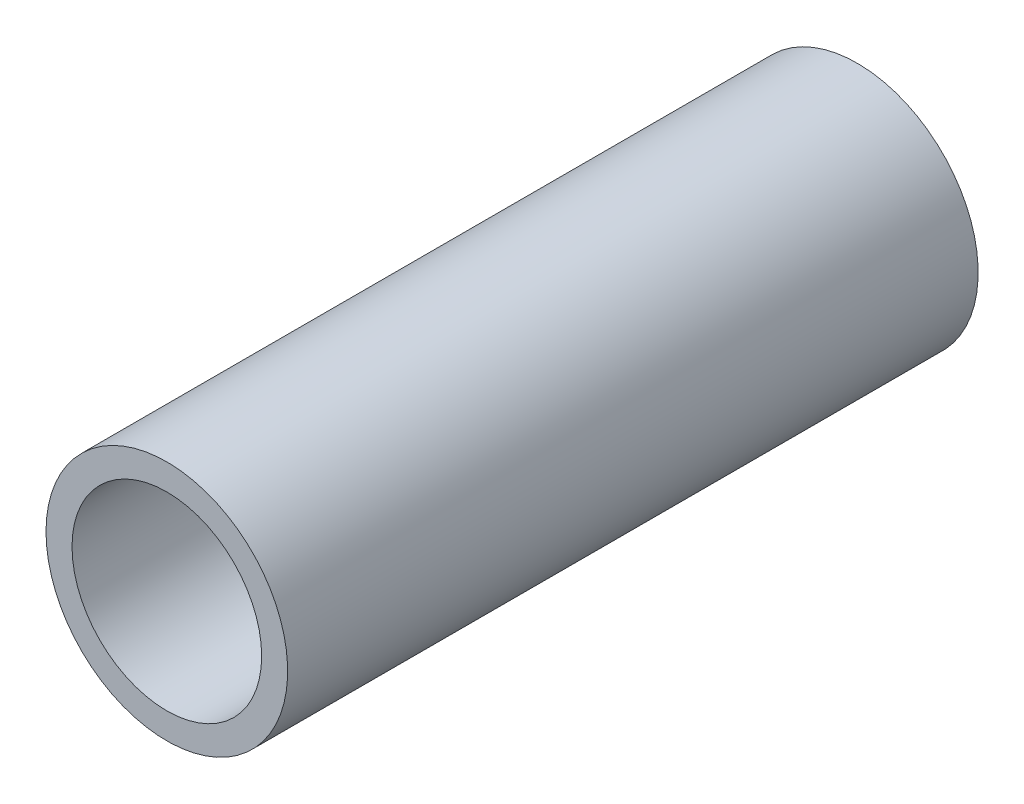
from build123d import *

# Parameters (mm, degrees)
SKETCH1_R      = 13.335
SKETCH1_R_2    = 10.4648
EXTRUDE1_DEPTH = 76.2


with BuildPart() as part:
    # Sketch1 → Extrude1 (new body)
    with BuildSketch(Plane.XY):
        with Locations(Location((0, 0, 0), (0, 0, 180))):
            Circle(SKETCH1_R)
        with Locations(Location((0, 0, 0), (0, 0, 180))):
            Circle(SKETCH1_R_2, mode=Mode.SUBTRACT)
    extrude(amount=EXTRUDE1_DEPTH)


solid = part.part
